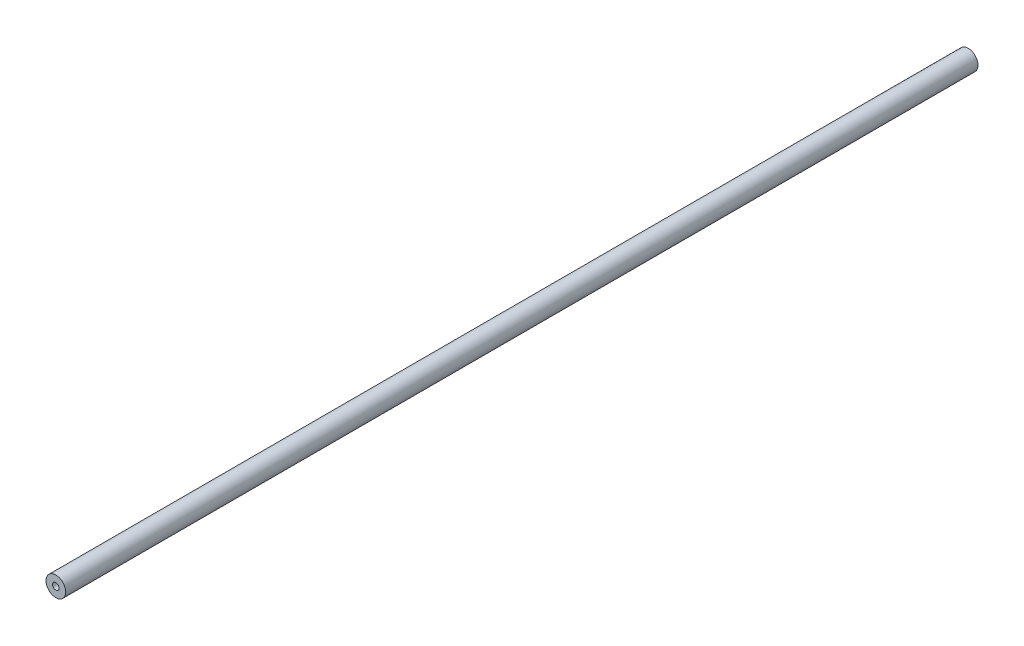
ISO-10303-21;
HEADER;
FILE_DESCRIPTION(('STEP AP214'),'2;1');
FILE_NAME('part.step','',(''),(''),'','','');
FILE_SCHEMA(('AUTOMOTIVE_DESIGN { 1 0 10303 214 1 1 1 1 }'));
ENDSEC;
DATA;
#1=APPLICATION_CONTEXT('core data for automotive mechanical design processes');
#2=APPLICATION_PROTOCOL_DEFINITION('international standard','automotive_design',2000,#1);
#3=PRODUCT_CONTEXT('',#1,'mechanical');
#4=PRODUCT('Part','Part','',(#3));
#5=PRODUCT_RELATED_PRODUCT_CATEGORY('part','',(#4));
#6=PRODUCT_DEFINITION_FORMATION('','',#4);
#7=PRODUCT_DEFINITION_CONTEXT('part definition',#1,'design');
#8=PRODUCT_DEFINITION('design','',#6,#7);
#9=PRODUCT_DEFINITION_SHAPE('','',#8);
#10=(LENGTH_UNIT() NAMED_UNIT(*) SI_UNIT(.MILLI.,.METRE.));
#11=(NAMED_UNIT(*) PLANE_ANGLE_UNIT() SI_UNIT($,.RADIAN.));
#12=(NAMED_UNIT(*) SI_UNIT($,.STERADIAN.) SOLID_ANGLE_UNIT());
#13=UNCERTAINTY_MEASURE_WITH_UNIT(LENGTH_MEASURE(1.E-05),#10,'distance_accuracy_value','');
#14=(GEOMETRIC_REPRESENTATION_CONTEXT(3) GLOBAL_UNCERTAINTY_ASSIGNED_CONTEXT((#13)) GLOBAL_UNIT_ASSIGNED_CONTEXT((#10,
#11,#12)) REPRESENTATION_CONTEXT('',''));
#15=CARTESIAN_POINT('',(0.,0.,0.));
#16=DIRECTION('',(0.,0.,1.));
#17=DIRECTION('',(1.,0.,0.));
#18=AXIS2_PLACEMENT_3D('',#15,#16,#17);
#19=CARTESIAN_POINT('',(0.,0.,347.5));
#20=DIRECTION('',(0.,0.,-1.));
#21=DIRECTION('',(-1.,0.,0.));
#22=AXIS2_PLACEMENT_3D('',#19,#20,#21);
#23=CYLINDRICAL_SURFACE('',#22,7.5);
#24=CARTESIAN_POINT('',(0.,0.,347.5));
#25=DIRECTION('',(0.,0.,1.));
#26=DIRECTION('',(1.,0.,0.));
#27=AXIS2_PLACEMENT_3D('',#24,#25,#26);
#28=CIRCLE('',#27,7.5);
#29=CARTESIAN_POINT('',(7.5,0.,347.5));
#30=VERTEX_POINT('',#29);
#31=EDGE_CURVE('E11',#30,#30,#28,.T.);
#32=ORIENTED_EDGE('',*,*,#31,.F.);
#33=EDGE_LOOP('',(#32));
#34=FACE_BOUND('',#33,.T.);
#35=CARTESIAN_POINT('',(0.,0.,-347.5));
#36=DIRECTION('',(0.,0.,1.));
#37=DIRECTION('',(1.,0.,0.));
#38=AXIS2_PLACEMENT_3D('',#35,#36,#37);
#39=CIRCLE('',#38,7.5);
#40=CARTESIAN_POINT('',(7.5,0.,-347.5));
#41=VERTEX_POINT('',#40);
#42=EDGE_CURVE('E46',#41,#41,#39,.T.);
#43=ORIENTED_EDGE('',*,*,#42,.T.);
#44=EDGE_LOOP('',(#43));
#45=FACE_BOUND('',#44,.T.);
#46=ADVANCED_FACE('F38',(#34,#45),#23,.T.);
#47=CARTESIAN_POINT('',(0.,0.,347.5));
#48=DIRECTION('',(0.,0.,1.));
#49=DIRECTION('',(1.,0.,0.));
#50=AXIS2_PLACEMENT_3D('',#47,#48,#49);
#51=PLANE('',#50);
#52=CARTESIAN_POINT('',(0.,0.,347.5));
#53=DIRECTION('',(0.,0.,1.));
#54=DIRECTION('',(1.,0.,0.));
#55=AXIS2_PLACEMENT_3D('',#52,#53,#54);
#56=CIRCLE('',#55,2.5);
#57=CARTESIAN_POINT('',(2.5,0.,347.5));
#58=VERTEX_POINT('',#57);
#59=EDGE_CURVE('E72',#58,#58,#56,.T.);
#60=ORIENTED_EDGE('',*,*,#59,.F.);
#61=EDGE_LOOP('',(#60));
#62=FACE_BOUND('',#61,.T.);
#63=ORIENTED_EDGE('',*,*,#31,.T.);
#64=EDGE_LOOP('',(#63));
#65=FACE_BOUND('',#64,.T.);
#66=ADVANCED_FACE('F83',(#62,#65),#51,.T.);
#67=CARTESIAN_POINT('',(0.,0.,-347.5));
#68=DIRECTION('',(0.,0.,1.));
#69=DIRECTION('',(1.,0.,0.));
#70=AXIS2_PLACEMENT_3D('',#67,#68,#69);
#71=PLANE('',#70);
#72=CARTESIAN_POINT('',(0.,0.,-347.5));
#73=DIRECTION('',(0.,0.,-1.));
#74=DIRECTION('',(-1.,0.,0.));
#75=AXIS2_PLACEMENT_3D('',#72,#73,#74);
#76=CIRCLE('',#75,2.49999999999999);
#77=CARTESIAN_POINT('',(-2.49999999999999,0.,-347.5));
#78=VERTEX_POINT('',#77);
#79=EDGE_CURVE('E62',#78,#78,#76,.T.);
#80=ORIENTED_EDGE('',*,*,#79,.F.);
#81=EDGE_LOOP('',(#80));
#82=FACE_BOUND('',#81,.T.);
#83=ORIENTED_EDGE('',*,*,#42,.F.);
#84=EDGE_LOOP('',(#83));
#85=FACE_BOUND('',#84,.T.);
#86=ADVANCED_FACE('F80',(#82,#85),#71,.F.);
#87=CARTESIAN_POINT('',(0.,0.,347.5));
#88=DIRECTION('',(0.,0.,1.));
#89=DIRECTION('',(1.,0.,0.));
#90=AXIS2_PLACEMENT_3D('',#87,#88,#89);
#91=CYLINDRICAL_SURFACE('',#90,2.5);
#92=CARTESIAN_POINT('',(0.,0.,327.5));
#93=DIRECTION('',(0.,0.,1.));
#94=DIRECTION('',(1.,0.,0.));
#95=AXIS2_PLACEMENT_3D('',#92,#93,#94);
#96=CIRCLE('',#95,2.5);
#97=CARTESIAN_POINT('',(2.5,0.,327.5));
#98=VERTEX_POINT('',#97);
#99=EDGE_CURVE('E66',#98,#98,#96,.T.);
#100=ORIENTED_EDGE('',*,*,#99,.F.);
#101=EDGE_LOOP('',(#100));
#102=FACE_BOUND('',#101,.T.);
#103=ORIENTED_EDGE('',*,*,#59,.T.);
#104=EDGE_LOOP('',(#103));
#105=FACE_BOUND('',#104,.T.);
#106=ADVANCED_FACE('F82',(#102,#105),#91,.F.);
#107=CARTESIAN_POINT('',(0.,0.,327.5));
#108=DIRECTION('',(0.,0.,1.));
#109=DIRECTION('',(1.,0.,0.));
#110=AXIS2_PLACEMENT_3D('',#107,#108,#109);
#111=CONICAL_SURFACE('',#110,2.5,1.02974425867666);
#112=CARTESIAN_POINT('',(0.,0.,325.997848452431));
#113=VERTEX_POINT('',#112);
#114=VERTEX_LOOP('',#113);
#115=FACE_BOUND('',#114,.T.);
#116=ORIENTED_EDGE('',*,*,#99,.T.);
#117=EDGE_LOOP('',(#116));
#118=FACE_BOUND('',#117,.T.);
#119=ADVANCED_FACE('F90',(#115,#118),#111,.F.);
#120=CARTESIAN_POINT('',(0.,0.,-347.5));
#121=DIRECTION('',(0.,0.,-1.));
#122=DIRECTION('',(-1.,0.,0.));
#123=AXIS2_PLACEMENT_3D('',#120,#121,#122);
#124=CYLINDRICAL_SURFACE('',#123,2.49999999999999);
#125=CARTESIAN_POINT('',(0.,0.,-327.5));
#126=DIRECTION('',(0.,0.,-1.));
#127=DIRECTION('',(-1.,0.,0.));
#128=AXIS2_PLACEMENT_3D('',#125,#126,#127);
#129=CIRCLE('',#128,2.49999999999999);
#130=CARTESIAN_POINT('',(-2.49999999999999,0.,-327.5));
#131=VERTEX_POINT('',#130);
#132=EDGE_CURVE('E59',#131,#131,#129,.T.);
#133=ORIENTED_EDGE('',*,*,#132,.F.);
#134=EDGE_LOOP('',(#133));
#135=FACE_BOUND('',#134,.T.);
#136=ORIENTED_EDGE('',*,*,#79,.T.);
#137=EDGE_LOOP('',(#136));
#138=FACE_BOUND('',#137,.T.);
#139=ADVANCED_FACE('F55',(#135,#138),#124,.F.);
#140=CARTESIAN_POINT('',(0.,0.,-327.5));
#141=DIRECTION('',(0.,0.,-1.));
#142=DIRECTION('',(-1.,0.,0.));
#143=AXIS2_PLACEMENT_3D('',#140,#141,#142);
#144=CONICAL_SURFACE('',#143,2.49999999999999,1.02974425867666);
#145=CARTESIAN_POINT('',(0.,0.,-325.997848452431));
#146=VERTEX_POINT('',#145);
#147=VERTEX_LOOP('',#146);
#148=FACE_BOUND('',#147,.T.);
#149=ORIENTED_EDGE('',*,*,#132,.T.);
#150=EDGE_LOOP('',(#149));
#151=FACE_BOUND('',#150,.T.);
#152=ADVANCED_FACE('F52',(#148,#151),#144,.F.);
#153=CLOSED_SHELL('',(#46,#66,#86,#106,#119,#139,#152));
#154=MANIFOLD_SOLID_BREP('B2',#153);
#155=ADVANCED_BREP_SHAPE_REPRESENTATION('',(#18,#154),#14);
#156=SHAPE_DEFINITION_REPRESENTATION(#9,#155);
ENDSEC;
END-ISO-10303-21;
